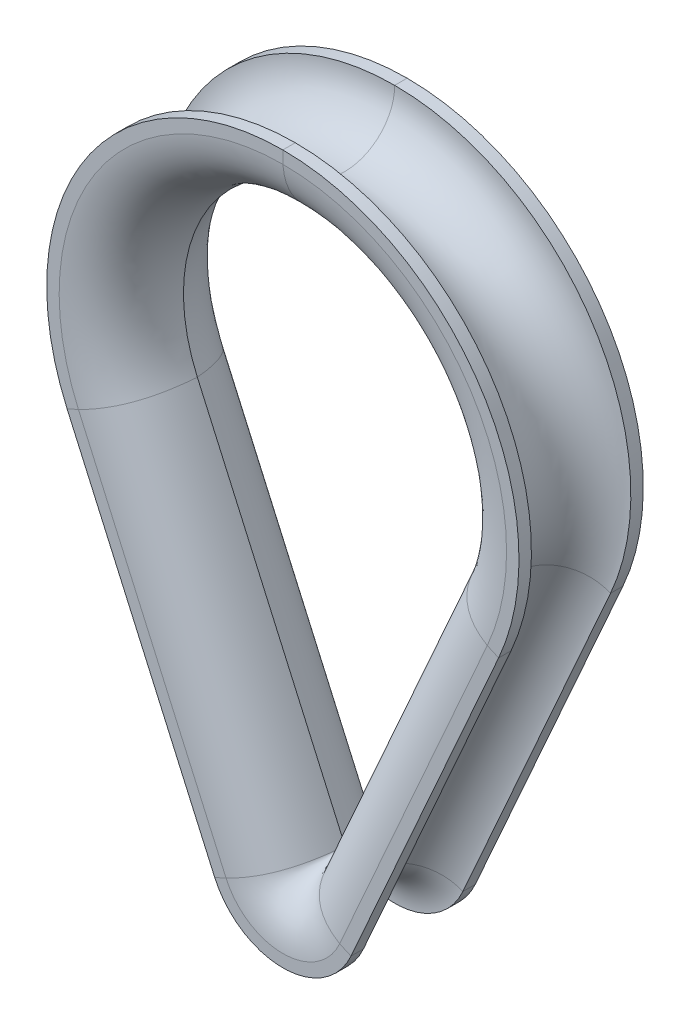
from build123d import *


with BuildPart() as part:
    # Sweep3: sweep along a path in Sketch1
    with BuildLine(Plane.XY) as sweep3_path:
        Line((-17.361477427, -7.71875), (-5.482571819, -34.4375))
        ThreePointArc((-5.482571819, -34.4375), (0, -38), (5.482571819, -34.4375))
        Line((5.482571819, -34.4375), (17.361477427, -7.71875))
        ThreePointArc((17.361477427, -7.71875), (0, 19), (-17.361477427, -7.71875))
    # Sketch2 → Sweep3 (sweep)
    with BuildSketch(Plane(origin=(0, 0, 0), x_dir=(0, 0, -1), z_dir=(1, 0, 0))):
        with BuildLine():
            Line((-5, 19), (-4, 19))
            ThreePointArc((-4, 19), (0, 15), (4, 19))
            Line((4, 19), (5, 19))
            Line((5, 19), (5, 18))
            add(Edge.make_bspline(
                [(5, 18), (4.654037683, 13.806616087), (0, 13)],
                knots=[0, 0, 0, 1, 1, 1], degree=2))
            add(Edge.make_bspline(
                [(-5, 18), (-4.654037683, 13.806616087), (0, 13)],
                knots=[0, 0, 0, 1, 1, 1], degree=2))
            Line((-5, 18), (-5, 19))
        make_face()
    sweep(path=sweep3_path.line)


solid = part.part
